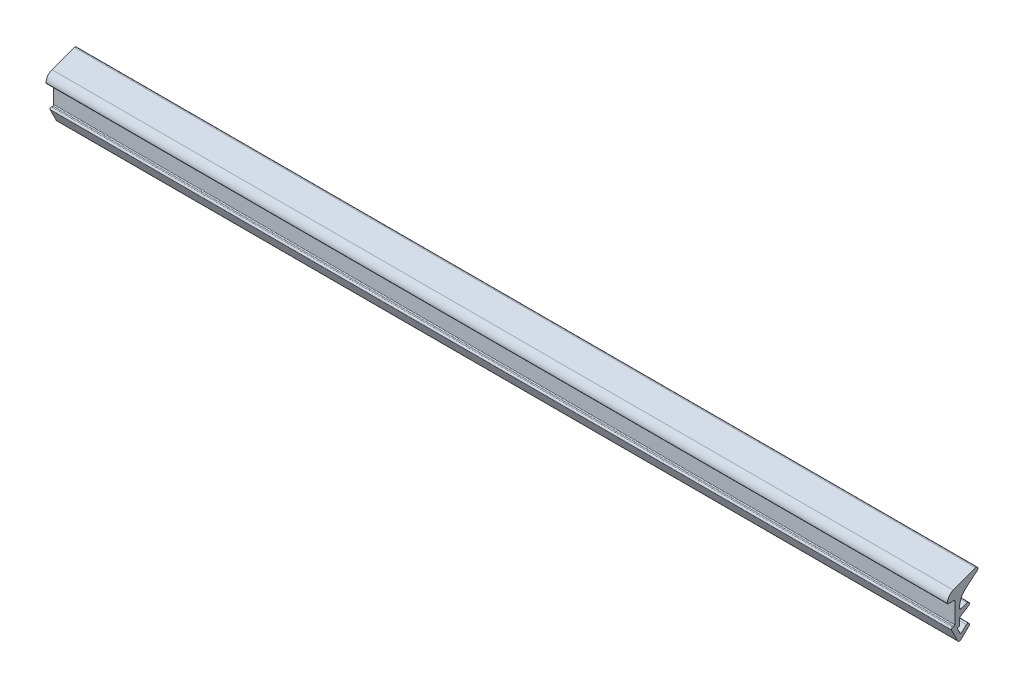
from build123d import *

# Parameters (mm, degrees)
PANEELITIIVISTEET_1_6022_PANEELITIIVISTE_DEPTH = 200


with BuildPart() as part:
    # Sketch1 → Paneelitiivisteet 1.6022 PANEELITIIVISTE (new body)
    with BuildSketch(Plane(origin=(0, 0, 0), x_dir=(0, 0, -1), z_dir=(1, 0, 0))):
        with BuildLine():
            Line((1.588409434, 3.760522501), (4.116674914, 5.881989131))
            ThreePointArc((4.116674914, 5.881989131), (4.205970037, 6.388406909), (3.722751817, 6.564283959))
            Line((3.722751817, 6.564283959), (-1.224480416, 4.763638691))
            ThreePointArc((-1.224480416, 4.763638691), (-2.178744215, 4.031406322), (-2.540440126, 2.884253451))
            ThreePointArc((-2.540440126, 2.884253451), (-2.483078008, 2.745769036), (-2.344593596, 2.688406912))
            Line((-2.344593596, 2.688406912), (-1.040440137, 2.688406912))
            ThreePointArc((-1.040440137, 2.688406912), (-0.899018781, 2.629828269), (-0.840440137, 2.488406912))
            Line((-0.840440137, 2.488406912), (-0.840440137, -2.111593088))
            ThreePointArc((-0.840440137, -2.111593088), (-0.899018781, -2.253014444), (-1.040440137, -2.311593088))
            Line((-1.040440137, -2.311593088), (-1.340440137, -2.311593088))
            ThreePointArc((-1.340440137, -2.311593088), (-1.595077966, -2.452975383), (-1.609707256, -2.74386258))
            Line((-1.609707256, -2.74386258), (-0.289218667, -5.432042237))
            ThreePointArc((-0.289218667, -5.432042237), (0.073485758, -5.704128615), (0.506972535, -5.571182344))
            Line((0.506972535, -5.571182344), (2.237490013, -3.899264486))
            ThreePointArc((2.237490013, -3.899264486), (2.247231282, -3.33366294), (1.681629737, -3.323921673))
            Line((1.681629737, -3.323921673), (0.595814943, -4.372968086))
            ThreePointArc((0.595814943, -4.372968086), (0.422420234, -4.426146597), (0.277338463, -4.317312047))
            Line((0.277338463, -4.317312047), (-0.271619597, -3.199772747))
            ThreePointArc((-0.271619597, -3.199772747), (-0.261866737, -3.005847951), (-0.092108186, -2.911593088))
            Line((-0.092108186, -2.911593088), (-0.090440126, -2.911593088))
            ThreePointArc((-0.090440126, -2.911593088), (0.08633657, -2.838369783), (0.159559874, -2.661593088))
            Line((0.159559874, -2.661593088), (0.159559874, -1.374321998))
            ThreePointArc((0.159559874, -1.374321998), (0.197173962, -1.228879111), (0.300584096, -1.119907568))
            Line((0.300584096, -1.119907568), (2.171527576, 0.049187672))
            ThreePointArc((2.171527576, 0.049187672), (2.319077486, 0.563755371), (1.822751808, 0.764283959))
            Line((1.822751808, 0.764283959), (0.562165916, 0.305468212))
            ThreePointArc((0.562165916, 0.305468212), (0.287486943, 0.341630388), (0.159559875, 0.587376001))
            Line((0.159559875, 0.587376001), (0.159559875, 0.696344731))
            ThreePointArc((0.159559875, 0.696344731), (0.534328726, 2.386817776), (1.588409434, 3.760522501))
        make_face()
    extrude(amount=PANEELITIIVISTEET_1_6022_PANEELITIIVISTE_DEPTH)


solid = part.part
